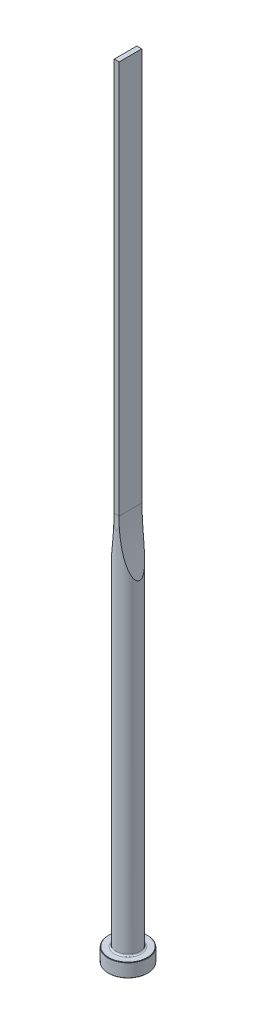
from build123d import *

# Parameters (mm, degrees)
CUT_EXTRUDE1_DEPTH = 7.5
CUT_EXTRUDE2_DEPTH = 7.5


with BuildPart() as part:
    # Sketch1 → Revolve1 (revolve)
    with BuildSketch(Plane.XY, mode=Mode.PRIVATE) as revolve1_sk:
        with BuildLine():
            Line((0, 0), (9.8, 0))
            Line((9.8, 0), (10, 0.2))
            Line((10, 0.2), (10, 6.8))
            Line((10, 6.8), (9.8, 7))
            Line((9.8, 7), (6.8, 7))
            ThreePointArc((6.8, 7), (6.234314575, 7.234314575), (6, 7.8))
            Line((6, 7.8), (6, 400))
            Line((6, 400), (0, 400))
            Line((0, 400), (0, 0))
        make_face()
    revolve(revolve1_sk.sketch.rotate(Axis((0, 400, 0), (0, -1, 0)), 180), axis=Axis((0, 400, 0), (0, -1, 0)))

    # Sketch2 → Cut-Extrude1 (cut, symmetric)
    with BuildSketch(Plane.XY):
        with BuildLine():
            Line((1.25, 400), (1.25, 200))
            ThreePointArc((1.25, 200), (2.445439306, 185.379808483), (6, 171.148007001))
            Line((6, 171.148007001), (6, 400))
            Line((6, 400), (1.25, 400))
        make_face()
        with BuildLine():
            Line((-1.25, 400), (-1.25, 200))
            ThreePointArc((-1.25, 200), (-2.445439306, 185.379808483), (-6, 171.148007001))
            Line((-6, 171.148007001), (-6, 400))
            Line((-6, 400), (-1.25, 400))
        make_face()
    extrude(amount=CUT_EXTRUDE1_DEPTH, both=True, mode=Mode.SUBTRACT)

    # Sketch3 → Cut-Extrude2 (cut, symmetric)
    with BuildSketch(Plane(origin=(0, 0, 0), x_dir=(0, 0, -1), z_dir=(1, 0, 0))):
        with BuildLine():
            Line((5.75, 400), (5.75, 200))
            ThreePointArc((5.75, 200), (5.812521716, 196.645898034), (6, 193.296456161))
            Line((6, 193.296456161), (6, 400))
            Line((6, 400), (5.75, 400))
        make_face()
        with BuildLine():
            Line((-5.75, 400), (-5.75, 200))
            ThreePointArc((-5.75, 200), (-5.812521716, 196.645898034), (-6, 193.296456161))
            Line((-6, 193.296456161), (-6, 400))
            Line((-6, 400), (-5.75, 400))
        make_face()
    extrude(amount=CUT_EXTRUDE2_DEPTH, both=True, mode=Mode.SUBTRACT)


solid = part.part
